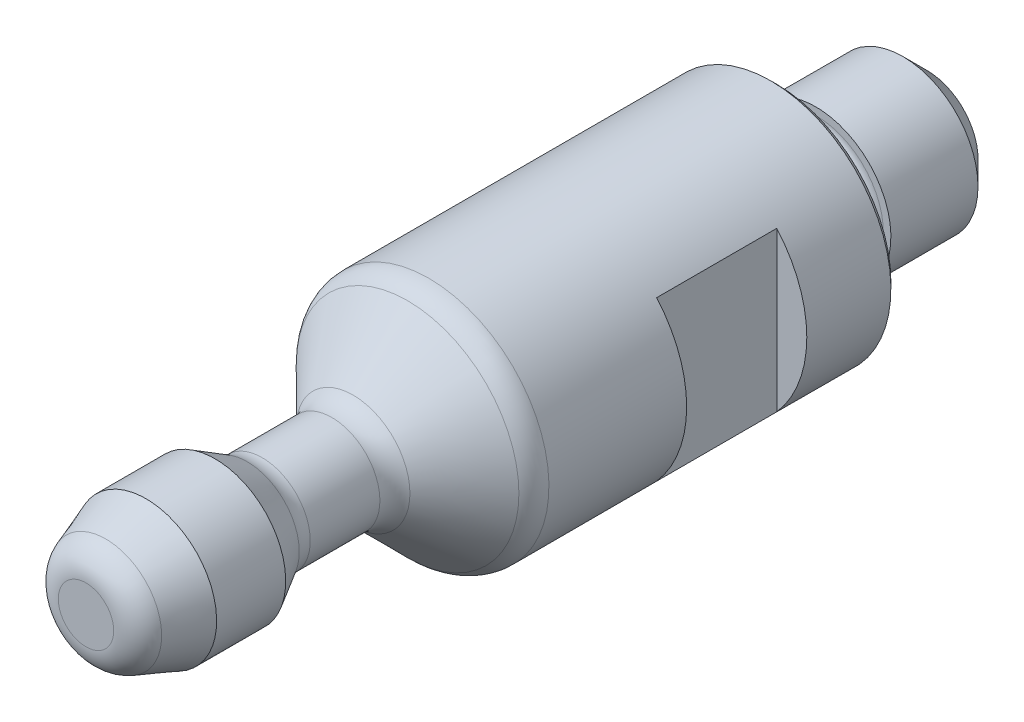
ISO-10303-21;
HEADER;
FILE_DESCRIPTION(('STEP AP214'),'2;1');
FILE_NAME('part.step','',(''),(''),'','','');
FILE_SCHEMA(('AUTOMOTIVE_DESIGN { 1 0 10303 214 1 1 1 1 }'));
ENDSEC;
DATA;
#1=APPLICATION_CONTEXT('core data for automotive mechanical design processes');
#2=APPLICATION_PROTOCOL_DEFINITION('international standard','automotive_design',2000,#1);
#3=PRODUCT_CONTEXT('',#1,'mechanical');
#4=PRODUCT('Part','Part','',(#3));
#5=PRODUCT_RELATED_PRODUCT_CATEGORY('part','',(#4));
#6=PRODUCT_DEFINITION_FORMATION('','',#4);
#7=PRODUCT_DEFINITION_CONTEXT('part definition',#1,'design');
#8=PRODUCT_DEFINITION('design','',#6,#7);
#9=PRODUCT_DEFINITION_SHAPE('','',#8);
#10=(LENGTH_UNIT() NAMED_UNIT(*) SI_UNIT(.MILLI.,.METRE.));
#11=(NAMED_UNIT(*) PLANE_ANGLE_UNIT() SI_UNIT($,.RADIAN.));
#12=(NAMED_UNIT(*) SI_UNIT($,.STERADIAN.) SOLID_ANGLE_UNIT());
#13=UNCERTAINTY_MEASURE_WITH_UNIT(LENGTH_MEASURE(1.E-05),#10,'distance_accuracy_value','');
#14=(GEOMETRIC_REPRESENTATION_CONTEXT(3) GLOBAL_UNCERTAINTY_ASSIGNED_CONTEXT((#13)) GLOBAL_UNIT_ASSIGNED_CONTEXT((#10,
#11,#12)) REPRESENTATION_CONTEXT('',''));
#15=CARTESIAN_POINT('',(0.,0.,0.));
#16=DIRECTION('',(0.,0.,1.));
#17=DIRECTION('',(1.,0.,0.));
#18=AXIS2_PLACEMENT_3D('',#15,#16,#17);
#19=CARTESIAN_POINT('',(2.5,0.,0.));
#20=DIRECTION('',(0.,0.,-1.));
#21=DIRECTION('',(0.,1.,0.));
#22=AXIS2_PLACEMENT_3D('',#19,#20,#21);
#23=PLANE('',#22);
#24=CARTESIAN_POINT('',(0.,0.,0.));
#25=DIRECTION('',(0.,0.,-1.));
#26=DIRECTION('',(0.,1.,0.));
#27=AXIS2_PLACEMENT_3D('',#24,#25,#26);
#28=CIRCLE('',#27,2.25);
#29=CARTESIAN_POINT('',(0.,2.25,0.));
#30=VERTEX_POINT('',#29);
#31=EDGE_CURVE('E111',#30,#30,#28,.F.);
#32=ORIENTED_EDGE('',*,*,#31,.T.);
#33=EDGE_LOOP('',(#32));
#34=FACE_BOUND('',#33,.T.);
#35=CARTESIAN_POINT('',(0.,0.,0.));
#36=DIRECTION('',(0.,0.,-1.));
#37=DIRECTION('',(0.,1.,0.));
#38=AXIS2_PLACEMENT_3D('',#35,#36,#37);
#39=CIRCLE('',#38,3.8);
#40=CARTESIAN_POINT('',(0.,3.8,0.));
#41=VERTEX_POINT('',#40);
#42=EDGE_CURVE('E108',#41,#41,#39,.T.);
#43=ORIENTED_EDGE('',*,*,#42,.T.);
#44=EDGE_LOOP('',(#43));
#45=FACE_BOUND('',#44,.T.);
#46=ADVANCED_FACE('F14',(#34,#45),#23,.T.);
#47=CARTESIAN_POINT('',(0.,0.,0.));
#48=DIRECTION('',(0.,0.,1.));
#49=DIRECTION('',(0.,-1.,0.));
#50=AXIS2_PLACEMENT_3D('',#47,#48,#49);
#51=CYLINDRICAL_SURFACE('',#50,4.);
#52=CARTESIAN_POINT('',(0.,0.,11.5857864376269));
#53=DIRECTION('',(0.,0.,-1.));
#54=DIRECTION('',(0.,1.,0.));
#55=AXIS2_PLACEMENT_3D('',#52,#53,#54);
#56=CIRCLE('',#55,4.);
#57=CARTESIAN_POINT('',(0.,4.,11.5857864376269));
#58=VERTEX_POINT('',#57);
#59=EDGE_CURVE('E9',#58,#58,#56,.T.);
#60=ORIENTED_EDGE('',*,*,#59,.T.);
#61=EDGE_LOOP('',(#60));
#62=FACE_BOUND('',#61,.T.);
#63=CARTESIAN_POINT('',(0.,0.,7.));
#64=DIRECTION('',(0.,0.,1.));
#65=DIRECTION('',(1.,0.,0.));
#66=AXIS2_PLACEMENT_3D('',#63,#64,#65);
#67=CIRCLE('',#66,4.);
#68=CARTESIAN_POINT('',(-3.,-2.6457513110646,7.));
#69=VERTEX_POINT('',#68);
#70=CARTESIAN_POINT('',(-3.,2.6457513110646,7.));
#71=VERTEX_POINT('',#70);
#72=EDGE_CURVE('E56',#69,#71,#67,.F.);
#73=ORIENTED_EDGE('',*,*,#72,.F.);
#74=DIRECTION('',(0.,0.,1.));
#75=VECTOR('',#74,1.);
#76=CARTESIAN_POINT('',(-3.,-2.6457513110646,0.));
#77=LINE('',#76,#75);
#78=CARTESIAN_POINT('',(-3.,-2.6457513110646,3.));
#79=VERTEX_POINT('',#78);
#80=EDGE_CURVE('E60',#79,#69,#77,.T.);
#81=ORIENTED_EDGE('',*,*,#80,.F.);
#82=CARTESIAN_POINT('',(0.,0.,3.));
#83=DIRECTION('',(0.,0.,-1.));
#84=DIRECTION('',(0.,1.,0.));
#85=AXIS2_PLACEMENT_3D('',#82,#83,#84);
#86=CIRCLE('',#85,4.);
#87=CARTESIAN_POINT('',(-3.,2.6457513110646,3.));
#88=VERTEX_POINT('',#87);
#89=EDGE_CURVE('E74',#88,#79,#86,.F.);
#90=ORIENTED_EDGE('',*,*,#89,.F.);
#91=DIRECTION('',(0.,0.,1.));
#92=VECTOR('',#91,1.);
#93=CARTESIAN_POINT('',(-3.,2.6457513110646,0.));
#94=LINE('',#93,#92);
#95=EDGE_CURVE('E62',#71,#88,#94,.F.);
#96=ORIENTED_EDGE('',*,*,#95,.F.);
#97=EDGE_LOOP('',(#73,#81,#90,#96));
#98=FACE_BOUND('',#97,.T.);
#99=DIRECTION('',(0.,0.,1.));
#100=VECTOR('',#99,1.);
#101=CARTESIAN_POINT('',(3.,-2.6457513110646,0.));
#102=LINE('',#101,#100);
#103=CARTESIAN_POINT('',(3.,-2.6457513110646,7.));
#104=VERTEX_POINT('',#103);
#105=CARTESIAN_POINT('',(3.,-2.64575131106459,3.));
#106=VERTEX_POINT('',#105);
#107=EDGE_CURVE('E126',#104,#106,#102,.F.);
#108=ORIENTED_EDGE('',*,*,#107,.F.);
#109=CARTESIAN_POINT('',(0.,0.,7.));
#110=DIRECTION('',(0.,0.,1.));
#111=DIRECTION('',(1.,0.,0.));
#112=AXIS2_PLACEMENT_3D('',#109,#110,#111);
#113=CIRCLE('',#112,4.);
#114=CARTESIAN_POINT('',(3.,2.6457513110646,7.));
#115=VERTEX_POINT('',#114);
#116=EDGE_CURVE('E35',#115,#104,#113,.F.);
#117=ORIENTED_EDGE('',*,*,#116,.F.);
#118=DIRECTION('',(0.,0.,1.));
#119=VECTOR('',#118,1.);
#120=CARTESIAN_POINT('',(3.,2.6457513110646,0.));
#121=LINE('',#120,#119);
#122=CARTESIAN_POINT('',(3.,2.64575131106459,3.));
#123=VERTEX_POINT('',#122);
#124=EDGE_CURVE('E29',#123,#115,#121,.T.);
#125=ORIENTED_EDGE('',*,*,#124,.F.);
#126=CARTESIAN_POINT('',(0.,0.,3.));
#127=DIRECTION('',(0.,0.,-1.));
#128=DIRECTION('',(0.,1.,0.));
#129=AXIS2_PLACEMENT_3D('',#126,#127,#128);
#130=CIRCLE('',#129,4.);
#131=EDGE_CURVE('E123',#106,#123,#130,.F.);
#132=ORIENTED_EDGE('',*,*,#131,.F.);
#133=EDGE_LOOP('',(#108,#117,#125,#132));
#134=FACE_BOUND('',#133,.T.);
#135=CARTESIAN_POINT('',(0.,0.,0.199999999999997));
#136=DIRECTION('',(0.,0.,-1.));
#137=DIRECTION('',(0.,1.,0.));
#138=AXIS2_PLACEMENT_3D('',#135,#136,#137);
#139=CIRCLE('',#138,4.);
#140=CARTESIAN_POINT('',(0.,4.,0.199999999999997));
#141=VERTEX_POINT('',#140);
#142=EDGE_CURVE('E105',#141,#141,#139,.F.);
#143=ORIENTED_EDGE('',*,*,#142,.T.);
#144=EDGE_LOOP('',(#143));
#145=FACE_BOUND('',#144,.T.);
#146=ADVANCED_FACE('F58',(#62,#98,#134,#145),#51,.T.);
#147=CARTESIAN_POINT('',(0.,0.,14.4));
#148=DIRECTION('',(0.,0.,-1.));
#149=DIRECTION('',(0.,1.,0.));
#150=AXIS2_PLACEMENT_3D('',#147,#148,#149);
#151=CONICAL_SURFACE('',#150,1.6,0.785398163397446);
#152=CARTESIAN_POINT('',(0.,0.,14.1071067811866));
#153=DIRECTION('',(0.,0.,-1.));
#154=DIRECTION('',(0.,1.,0.));
#155=AXIS2_PLACEMENT_3D('',#152,#153,#154);
#156=CIRCLE('',#155,1.89289321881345);
#157=CARTESIAN_POINT('',(0.,1.89289321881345,14.1071067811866));
#158=VERTEX_POINT('',#157);
#159=EDGE_CURVE('E22',#158,#158,#156,.T.);
#160=ORIENTED_EDGE('',*,*,#159,.T.);
#161=EDGE_LOOP('',(#160));
#162=FACE_BOUND('',#161,.T.);
#163=CARTESIAN_POINT('',(0.,0.,12.2928932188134));
#164=DIRECTION('',(0.,0.,1.));
#165=DIRECTION('',(0.,-1.,0.));
#166=AXIS2_PLACEMENT_3D('',#163,#164,#165);
#167=CIRCLE('',#166,3.70710678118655);
#168=CARTESIAN_POINT('',(0.,-3.70710678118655,12.2928932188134));
#169=VERTEX_POINT('',#168);
#170=EDGE_CURVE('E140',#169,#169,#167,.T.);
#171=ORIENTED_EDGE('',*,*,#170,.T.);
#172=EDGE_LOOP('',(#171));
#173=FACE_BOUND('',#172,.T.);
#174=ADVANCED_FACE('F145',(#162,#173),#151,.T.);
#175=CARTESIAN_POINT('',(0.,0.,0.));
#176=DIRECTION('',(0.,0.,1.));
#177=DIRECTION('',(0.,-1.,0.));
#178=AXIS2_PLACEMENT_3D('',#175,#176,#177);
#179=CYLINDRICAL_SURFACE('',#178,1.6);
#180=CARTESIAN_POINT('',(0.,0.,14.8142135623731));
#181=DIRECTION('',(0.,0.,1.));
#182=DIRECTION('',(0.,-1.,0.));
#183=AXIS2_PLACEMENT_3D('',#180,#181,#182);
#184=CIRCLE('',#183,1.6);
#185=CARTESIAN_POINT('',(0.,-1.6,14.8142135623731));
#186=VERTEX_POINT('',#185);
#187=EDGE_CURVE('E137',#186,#186,#184,.T.);
#188=ORIENTED_EDGE('',*,*,#187,.T.);
#189=EDGE_LOOP('',(#188));
#190=FACE_BOUND('',#189,.T.);
#191=CARTESIAN_POINT('',(0.,0.,17.1330127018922));
#192=DIRECTION('',(0.,0.,1.));
#193=DIRECTION('',(0.,-1.,0.));
#194=AXIS2_PLACEMENT_3D('',#191,#192,#193);
#195=CIRCLE('',#194,1.6);
#196=CARTESIAN_POINT('',(0.,-1.6,17.1330127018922));
#197=VERTEX_POINT('',#196);
#198=EDGE_CURVE('E134',#197,#197,#195,.F.);
#199=ORIENTED_EDGE('',*,*,#198,.T.);
#200=EDGE_LOOP('',(#199));
#201=FACE_BOUND('',#200,.T.);
#202=ADVANCED_FACE('F154',(#190,#201),#179,.T.);
#203=CARTESIAN_POINT('',(0.,0.,18.7));
#204=DIRECTION('',(0.,0.,1.));
#205=DIRECTION('',(0.,-1.,0.));
#206=AXIS2_PLACEMENT_3D('',#203,#204,#205);
#207=CONICAL_SURFACE('',#206,2.35,0.523598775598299);
#208=CARTESIAN_POINT('',(0.,0.,17.6330127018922));
#209=DIRECTION('',(0.,0.,1.));
#210=DIRECTION('',(0.,-1.,0.));
#211=AXIS2_PLACEMENT_3D('',#208,#209,#210);
#212=CIRCLE('',#211,1.73397459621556);
#213=CARTESIAN_POINT('',(0.,-1.73397459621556,17.6330127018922));
#214=VERTEX_POINT('',#213);
#215=EDGE_CURVE('E73',#214,#214,#212,.T.);
#216=ORIENTED_EDGE('',*,*,#215,.T.);
#217=EDGE_LOOP('',(#216));
#218=FACE_BOUND('',#217,.T.);
#219=CARTESIAN_POINT('',(0.,0.,18.7));
#220=DIRECTION('',(0.,0.,1.));
#221=DIRECTION('',(0.,-1.,0.));
#222=AXIS2_PLACEMENT_3D('',#219,#220,#221);
#223=CIRCLE('',#222,2.35);
#224=CARTESIAN_POINT('',(0.,-2.35,18.7));
#225=VERTEX_POINT('',#224);
#226=EDGE_CURVE('E90',#225,#225,#223,.T.);
#227=ORIENTED_EDGE('',*,*,#226,.F.);
#228=EDGE_LOOP('',(#227));
#229=FACE_BOUND('',#228,.T.);
#230=ADVANCED_FACE('F157',(#218,#229),#207,.T.);
#231=CARTESIAN_POINT('',(0.,0.,0.));
#232=DIRECTION('',(0.,0.,1.));
#233=DIRECTION('',(0.,-1.,0.));
#234=AXIS2_PLACEMENT_3D('',#231,#232,#233);
#235=CYLINDRICAL_SURFACE('',#234,2.35);
#236=ORIENTED_EDGE('',*,*,#226,.T.);
#237=EDGE_LOOP('',(#236));
#238=FACE_BOUND('',#237,.T.);
#239=CARTESIAN_POINT('',(0.,0.,21.));
#240=DIRECTION('',(0.,0.,1.));
#241=DIRECTION('',(0.,-1.,0.));
#242=AXIS2_PLACEMENT_3D('',#239,#240,#241);
#243=CIRCLE('',#242,2.35);
#244=CARTESIAN_POINT('',(0.,-2.35,21.));
#245=VERTEX_POINT('',#244);
#246=EDGE_CURVE('E87',#245,#245,#243,.T.);
#247=ORIENTED_EDGE('',*,*,#246,.F.);
#248=EDGE_LOOP('',(#247));
#249=FACE_BOUND('',#248,.T.);
#250=ADVANCED_FACE('F168',(#238,#249),#235,.T.);
#251=CARTESIAN_POINT('',(0.,0.,23.));
#252=DIRECTION('',(0.,0.,-1.));
#253=DIRECTION('',(0.,1.,0.));
#254=AXIS2_PLACEMENT_3D('',#251,#252,#253);
#255=CONICAL_SURFACE('',#254,1.62205953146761,0.34906585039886);
#256=CARTESIAN_POINT('',(0.,0.,22.3420201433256));
#257=DIRECTION('',(0.,0.,1.));
#258=DIRECTION('',(0.,-1.,0.));
#259=AXIS2_PLACEMENT_3D('',#256,#257,#258);
#260=CIRCLE('',#259,1.86154461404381);
#261=CARTESIAN_POINT('',(0.,-1.86154461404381,22.3420201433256));
#262=VERTEX_POINT('',#261);
#263=EDGE_CURVE('E96',#262,#262,#260,.F.);
#264=ORIENTED_EDGE('',*,*,#263,.T.);
#265=EDGE_LOOP('',(#264));
#266=FACE_BOUND('',#265,.T.);
#267=ORIENTED_EDGE('',*,*,#246,.T.);
#268=EDGE_LOOP('',(#267));
#269=FACE_BOUND('',#268,.T.);
#270=ADVANCED_FACE('F174',(#266,#269),#255,.T.);
#271=CARTESIAN_POINT('',(1.62205953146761,0.,23.));
#272=DIRECTION('',(0.,0.,1.));
#273=DIRECTION('',(0.,-1.,0.));
#274=AXIS2_PLACEMENT_3D('',#271,#272,#273);
#275=PLANE('',#274);
#276=CARTESIAN_POINT('',(0.,0.,23.));
#277=DIRECTION('',(0.,0.,1.));
#278=DIRECTION('',(0.,-1.,0.));
#279=AXIS2_PLACEMENT_3D('',#276,#277,#278);
#280=CIRCLE('',#279,0.921851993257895);
#281=CARTESIAN_POINT('',(0.,-0.921851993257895,23.));
#282=VERTEX_POINT('',#281);
#283=EDGE_CURVE('E93',#282,#282,#280,.T.);
#284=ORIENTED_EDGE('',*,*,#283,.T.);
#285=EDGE_LOOP('',(#284));
#286=FACE_BOUND('',#285,.T.);
#287=ADVANCED_FACE('F179',(#286),#275,.T.);
#288=CARTESIAN_POINT('',(0.,0.,22.));
#289=DIRECTION('',(0.,0.,1.));
#290=DIRECTION('',(0.,-1.,0.));
#291=AXIS2_PLACEMENT_3D('',#288,#289,#290);
#292=DEGENERATE_TOROIDAL_SURFACE('',#291,0.921851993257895,1.,.T.);
#293=ORIENTED_EDGE('',*,*,#263,.F.);
#294=EDGE_LOOP('',(#293));
#295=FACE_BOUND('',#294,.T.);
#296=ORIENTED_EDGE('',*,*,#283,.F.);
#297=EDGE_LOOP('',(#296));
#298=FACE_BOUND('',#297,.T.);
#299=ADVANCED_FACE('F188',(#295,#298),#292,.T.);
#300=CARTESIAN_POINT('',(0.,0.,0.199999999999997));
#301=DIRECTION('',(0.,0.,1.));
#302=DIRECTION('',(0.,-1.,0.));
#303=AXIS2_PLACEMENT_3D('',#300,#301,#302);
#304=CONICAL_SURFACE('',#303,4.,0.785398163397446);
#305=ORIENTED_EDGE('',*,*,#42,.F.);
#306=EDGE_LOOP('',(#305));
#307=FACE_BOUND('',#306,.T.);
#308=ORIENTED_EDGE('',*,*,#142,.F.);
#309=EDGE_LOOP('',(#308));
#310=FACE_BOUND('',#309,.T.);
#311=ADVANCED_FACE('F205',(#307,#310),#304,.T.);
#312=CARTESIAN_POINT('',(2.5,0.,-1.3));
#313=DIRECTION('',(0.,0.,-1.));
#314=DIRECTION('',(0.,1.,0.));
#315=AXIS2_PLACEMENT_3D('',#312,#313,#314);
#316=PLANE('',#315);
#317=CARTESIAN_POINT('',(0.,0.,-1.3));
#318=DIRECTION('',(0.,0.,-1.));
#319=DIRECTION('',(0.,1.,0.));
#320=AXIS2_PLACEMENT_3D('',#317,#318,#319);
#321=CIRCLE('',#320,2.25);
#322=CARTESIAN_POINT('',(0.,2.25,-1.3));
#323=VERTEX_POINT('',#322);
#324=EDGE_CURVE('E120',#323,#323,#321,.T.);
#325=ORIENTED_EDGE('',*,*,#324,.T.);
#326=EDGE_LOOP('',(#325));
#327=FACE_BOUND('',#326,.T.);
#328=CARTESIAN_POINT('',(0.,0.,-1.3));
#329=DIRECTION('',(0.,0.,1.));
#330=DIRECTION('',(0.,-1.,0.));
#331=AXIS2_PLACEMENT_3D('',#328,#329,#330);
#332=CIRCLE('',#331,2.5);
#333=CARTESIAN_POINT('',(0.,-2.5,-1.3));
#334=VERTEX_POINT('',#333);
#335=EDGE_CURVE('E83',#334,#334,#332,.T.);
#336=ORIENTED_EDGE('',*,*,#335,.T.);
#337=EDGE_LOOP('',(#336));
#338=FACE_BOUND('',#337,.T.);
#339=ADVANCED_FACE('F215',(#327,#338),#316,.F.);
#340=CARTESIAN_POINT('',(0.,0.,0.));
#341=DIRECTION('',(0.,0.,1.));
#342=DIRECTION('',(0.,-1.,0.));
#343=AXIS2_PLACEMENT_3D('',#340,#341,#342);
#344=CYLINDRICAL_SURFACE('',#343,1.85);
#345=CARTESIAN_POINT('',(0.,0.,-0.4));
#346=DIRECTION('',(0.,0.,-1.));
#347=DIRECTION('',(0.,1.,0.));
#348=AXIS2_PLACEMENT_3D('',#345,#346,#347);
#349=CIRCLE('',#348,1.85);
#350=CARTESIAN_POINT('',(0.,1.85,-0.4));
#351=VERTEX_POINT('',#350);
#352=EDGE_CURVE('E117',#351,#351,#349,.T.);
#353=ORIENTED_EDGE('',*,*,#352,.T.);
#354=EDGE_LOOP('',(#353));
#355=FACE_BOUND('',#354,.T.);
#356=CARTESIAN_POINT('',(0.,0.,-0.9));
#357=DIRECTION('',(0.,0.,-1.));
#358=DIRECTION('',(0.,1.,0.));
#359=AXIS2_PLACEMENT_3D('',#356,#357,#358);
#360=CIRCLE('',#359,1.85);
#361=CARTESIAN_POINT('',(0.,1.85,-0.9));
#362=VERTEX_POINT('',#361);
#363=EDGE_CURVE('E114',#362,#362,#360,.F.);
#364=ORIENTED_EDGE('',*,*,#363,.T.);
#365=EDGE_LOOP('',(#364));
#366=FACE_BOUND('',#365,.T.);
#367=ADVANCED_FACE('F235',(#355,#366),#344,.T.);
#368=CARTESIAN_POINT('',(2.5,0.,-5.));
#369=DIRECTION('',(0.,0.,-1.));
#370=DIRECTION('',(0.,1.,0.));
#371=AXIS2_PLACEMENT_3D('',#368,#369,#370);
#372=PLANE('',#371);
#373=CARTESIAN_POINT('',(0.,0.,-5.));
#374=DIRECTION('',(0.,0.,-1.));
#375=DIRECTION('',(0.,1.,0.));
#376=AXIS2_PLACEMENT_3D('',#373,#374,#375);
#377=CIRCLE('',#376,1.7);
#378=CARTESIAN_POINT('',(0.,1.7,-5.));
#379=VERTEX_POINT('',#378);
#380=EDGE_CURVE('E102',#379,#379,#377,.T.);
#381=ORIENTED_EDGE('',*,*,#380,.T.);
#382=EDGE_LOOP('',(#381));
#383=FACE_BOUND('',#382,.T.);
#384=ADVANCED_FACE('F211',(#383),#372,.T.);
#385=CARTESIAN_POINT('',(0.,0.,-4.2));
#386=DIRECTION('',(0.,0.,1.));
#387=DIRECTION('',(0.,-1.,0.));
#388=AXIS2_PLACEMENT_3D('',#385,#386,#387);
#389=CONICAL_SURFACE('',#388,2.5,0.78539816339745);
#390=ORIENTED_EDGE('',*,*,#380,.F.);
#391=EDGE_LOOP('',(#390));
#392=FACE_BOUND('',#391,.T.);
#393=CARTESIAN_POINT('',(0.,0.,-4.2));
#394=DIRECTION('',(0.,0.,-1.));
#395=DIRECTION('',(0.,1.,0.));
#396=AXIS2_PLACEMENT_3D('',#393,#394,#395);
#397=CIRCLE('',#396,2.5);
#398=CARTESIAN_POINT('',(0.,2.5,-4.2));
#399=VERTEX_POINT('',#398);
#400=EDGE_CURVE('E99',#399,#399,#397,.F.);
#401=ORIENTED_EDGE('',*,*,#400,.F.);
#402=EDGE_LOOP('',(#401));
#403=FACE_BOUND('',#402,.T.);
#404=ADVANCED_FACE('F207',(#392,#403),#389,.T.);
#405=CARTESIAN_POINT('',(0.,0.,0.));
#406=DIRECTION('',(0.,0.,1.));
#407=DIRECTION('',(0.,-1.,0.));
#408=AXIS2_PLACEMENT_3D('',#405,#406,#407);
#409=CYLINDRICAL_SURFACE('',#408,2.5);
#410=ORIENTED_EDGE('',*,*,#335,.F.);
#411=EDGE_LOOP('',(#410));
#412=FACE_BOUND('',#411,.T.);
#413=ORIENTED_EDGE('',*,*,#400,.T.);
#414=EDGE_LOOP('',(#413));
#415=FACE_BOUND('',#414,.T.);
#416=ADVANCED_FACE('F210',(#412,#415),#409,.T.);
#417=CARTESIAN_POINT('',(0.,0.,-0.4));
#418=DIRECTION('',(0.,0.,-1.));
#419=DIRECTION('',(0.,1.,0.));
#420=AXIS2_PLACEMENT_3D('',#417,#418,#419);
#421=TOROIDAL_SURFACE('',#420,2.25,0.4);
#422=ORIENTED_EDGE('',*,*,#352,.F.);
#423=EDGE_LOOP('',(#422));
#424=FACE_BOUND('',#423,.T.);
#425=ORIENTED_EDGE('',*,*,#31,.F.);
#426=EDGE_LOOP('',(#425));
#427=FACE_BOUND('',#426,.T.);
#428=ADVANCED_FACE('F217',(#424,#427),#421,.F.);
#429=CARTESIAN_POINT('',(0.,0.,-0.9));
#430=DIRECTION('',(0.,0.,-1.));
#431=DIRECTION('',(0.,1.,0.));
#432=AXIS2_PLACEMENT_3D('',#429,#430,#431);
#433=TOROIDAL_SURFACE('',#432,2.25,0.4);
#434=ORIENTED_EDGE('',*,*,#324,.F.);
#435=EDGE_LOOP('',(#434));
#436=FACE_BOUND('',#435,.T.);
#437=ORIENTED_EDGE('',*,*,#363,.F.);
#438=EDGE_LOOP('',(#437));
#439=FACE_BOUND('',#438,.T.);
#440=ADVANCED_FACE('F220',(#436,#439),#433,.F.);
#441=CARTESIAN_POINT('',(4.,-5.,7.));
#442=DIRECTION('',(0.,0.,1.));
#443=DIRECTION('',(1.,0.,0.));
#444=AXIS2_PLACEMENT_3D('',#441,#442,#443);
#445=PLANE('',#444);
#446=ORIENTED_EDGE('',*,*,#116,.T.);
#447=DIRECTION('',(0.,1.,0.));
#448=VECTOR('',#447,1.);
#449=CARTESIAN_POINT('',(3.,-5.,7.));
#450=LINE('',#449,#448);
#451=EDGE_CURVE('E81',#104,#115,#450,.T.);
#452=ORIENTED_EDGE('',*,*,#451,.T.);
#453=EDGE_LOOP('',(#446,#452));
#454=FACE_BOUND('',#453,.T.);
#455=ADVANCED_FACE('F223',(#454),#445,.F.);
#456=CARTESIAN_POINT('',(3.,-5.,3.));
#457=DIRECTION('',(-1.,0.,0.));
#458=DIRECTION('',(0.,0.,1.));
#459=AXIS2_PLACEMENT_3D('',#456,#457,#458);
#460=PLANE('',#459);
#461=ORIENTED_EDGE('',*,*,#107,.T.);
#462=DIRECTION('',(0.,1.,0.));
#463=VECTOR('',#462,1.);
#464=CARTESIAN_POINT('',(3.,-5.,3.));
#465=LINE('',#464,#463);
#466=EDGE_CURVE('E78',#106,#123,#465,.T.);
#467=ORIENTED_EDGE('',*,*,#466,.T.);
#468=ORIENTED_EDGE('',*,*,#124,.T.);
#469=ORIENTED_EDGE('',*,*,#451,.F.);
#470=EDGE_LOOP('',(#461,#467,#468,#469));
#471=FACE_BOUND('',#470,.T.);
#472=ADVANCED_FACE('F229',(#471),#460,.F.);
#473=CARTESIAN_POINT('',(4.,-5.,3.));
#474=DIRECTION('',(0.,0.,-1.));
#475=DIRECTION('',(0.,1.,0.));
#476=AXIS2_PLACEMENT_3D('',#473,#474,#475);
#477=PLANE('',#476);
#478=ORIENTED_EDGE('',*,*,#466,.F.);
#479=ORIENTED_EDGE('',*,*,#131,.T.);
#480=EDGE_LOOP('',(#478,#479));
#481=FACE_BOUND('',#480,.T.);
#482=ADVANCED_FACE('F249',(#481),#477,.F.);
#483=CARTESIAN_POINT('',(-4.,-5.,3.));
#484=DIRECTION('',(0.,0.,-1.));
#485=DIRECTION('',(0.,1.,0.));
#486=AXIS2_PLACEMENT_3D('',#483,#484,#485);
#487=PLANE('',#486);
#488=DIRECTION('',(0.,1.,0.));
#489=VECTOR('',#488,1.);
#490=CARTESIAN_POINT('',(-3.,-5.,3.));
#491=LINE('',#490,#489);
#492=EDGE_CURVE('E72',#79,#88,#491,.T.);
#493=ORIENTED_EDGE('',*,*,#492,.T.);
#494=ORIENTED_EDGE('',*,*,#89,.T.);
#495=EDGE_LOOP('',(#493,#494));
#496=FACE_BOUND('',#495,.T.);
#497=ADVANCED_FACE('F427',(#496),#487,.F.);
#498=CARTESIAN_POINT('',(-3.,-5.,3.));
#499=DIRECTION('',(1.,0.,0.));
#500=DIRECTION('',(0.,-1.,0.));
#501=AXIS2_PLACEMENT_3D('',#498,#499,#500);
#502=PLANE('',#501);
#503=ORIENTED_EDGE('',*,*,#95,.T.);
#504=ORIENTED_EDGE('',*,*,#492,.F.);
#505=ORIENTED_EDGE('',*,*,#80,.T.);
#506=DIRECTION('',(0.,1.,0.));
#507=VECTOR('',#506,1.);
#508=CARTESIAN_POINT('',(-3.,-5.,7.));
#509=LINE('',#508,#507);
#510=EDGE_CURVE('E70',#69,#71,#509,.T.);
#511=ORIENTED_EDGE('',*,*,#510,.T.);
#512=EDGE_LOOP('',(#503,#504,#505,#511));
#513=FACE_BOUND('',#512,.T.);
#514=ADVANCED_FACE('F69',(#513),#502,.F.);
#515=CARTESIAN_POINT('',(-4.,-5.,7.));
#516=DIRECTION('',(0.,0.,1.));
#517=DIRECTION('',(1.,0.,0.));
#518=AXIS2_PLACEMENT_3D('',#515,#516,#517);
#519=PLANE('',#518);
#520=ORIENTED_EDGE('',*,*,#510,.F.);
#521=ORIENTED_EDGE('',*,*,#72,.T.);
#522=EDGE_LOOP('',(#520,#521));
#523=FACE_BOUND('',#522,.T.);
#524=ADVANCED_FACE('F76',(#523),#519,.F.);
#525=CARTESIAN_POINT('',(0.,0.,17.1330127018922));
#526=DIRECTION('',(0.,0.,1.));
#527=DIRECTION('',(0.,-1.,0.));
#528=AXIS2_PLACEMENT_3D('',#525,#526,#527);
#529=TOROIDAL_SURFACE('',#528,2.6,1.);
#530=ORIENTED_EDGE('',*,*,#198,.F.);
#531=EDGE_LOOP('',(#530));
#532=FACE_BOUND('',#531,.T.);
#533=ORIENTED_EDGE('',*,*,#215,.F.);
#534=EDGE_LOOP('',(#533));
#535=FACE_BOUND('',#534,.T.);
#536=ADVANCED_FACE('F151',(#532,#535),#529,.F.);
#537=CARTESIAN_POINT('',(0.,0.,14.8142135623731));
#538=DIRECTION('',(0.,0.,1.));
#539=DIRECTION('',(0.,-1.,0.));
#540=AXIS2_PLACEMENT_3D('',#537,#538,#539);
#541=TOROIDAL_SURFACE('',#540,2.6,1.);
#542=ORIENTED_EDGE('',*,*,#159,.F.);
#543=EDGE_LOOP('',(#542));
#544=FACE_BOUND('',#543,.T.);
#545=ORIENTED_EDGE('',*,*,#187,.F.);
#546=EDGE_LOOP('',(#545));
#547=FACE_BOUND('',#546,.T.);
#548=ADVANCED_FACE('F148',(#544,#547),#541,.F.);
#549=CARTESIAN_POINT('',(0.,0.,11.5857864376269));
#550=DIRECTION('',(0.,0.,-1.));
#551=DIRECTION('',(0.,1.,0.));
#552=AXIS2_PLACEMENT_3D('',#549,#550,#551);
#553=TOROIDAL_SURFACE('',#552,3.,1.);
#554=ORIENTED_EDGE('',*,*,#59,.F.);
#555=EDGE_LOOP('',(#554));
#556=FACE_BOUND('',#555,.T.);
#557=ORIENTED_EDGE('',*,*,#170,.F.);
#558=EDGE_LOOP('',(#557));
#559=FACE_BOUND('',#558,.T.);
#560=ADVANCED_FACE('F16',(#556,#559),#553,.T.);
#561=CLOSED_SHELL('',(#46,#146,#174,#202,#230,#250,#270,#287,#299,#311,#339,#367,#384,#404,#416,
#428,#440,#455,#472,#482,#497,#514,#524,#536,#548,#560));
#562=MANIFOLD_SOLID_BREP('B1',#561);
#563=ADVANCED_BREP_SHAPE_REPRESENTATION('',(#18,#562),#14);
#564=SHAPE_DEFINITION_REPRESENTATION(#9,#563);
ENDSEC;
END-ISO-10303-21;
